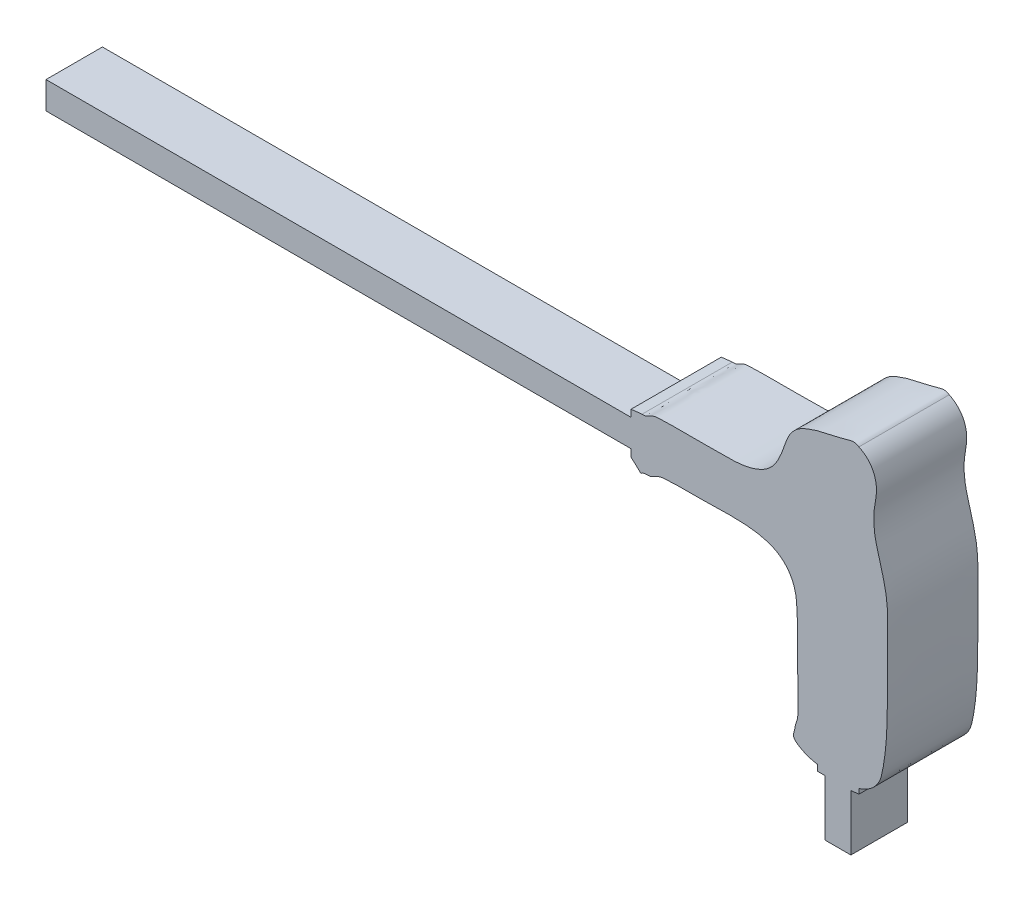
from build123d import *

# Parameters (mm, degrees)
BOSS_EXTRU_1_DEPTH      = 10
BOSS_EXTRU_1_DEPTH_BACK = 10
ESQUISSE2_W             = 5.766727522
ESQUISSE2_H             = 12.37574571
ESQUISSE2_W_2           = 129.608310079
ESQUISSE2_H_2           = 6.025962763
ENL_V_MAT_EXTRU_1_DEPTH = 7.5


with BuildPart() as part:
    # Esquisse1 → Boss.-Extru.1 (new, two sides: drawn at the far end of the back side and taken through both)
    with BuildSketch(Plane.XY.offset(-BOSS_EXTRU_1_DEPTH_BACK)):
        with BuildLine():
            Line((195.497714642, 123.990614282), (65.889404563, 123.990614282))
            Line((65.889404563, 123.990614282), (65.889404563, 117.964651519))
            Line((65.889404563, 117.964651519), (195.497714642, 117.964651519))
            Line((195.497714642, 117.964651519), (195.497714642, 116.351897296))
            Line((195.497714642, 116.351897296), (197.705183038, 114.30907528))
            add(Edge.make_bspline(
                [(236.843581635, 78.042521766), (235.28456265, 78.316299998), (233.521456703, 78.84463056), (231.198458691, 80.614398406), (231.780761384, 82.053226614), (231.859692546, 83.184464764), (232.290333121, 84.182278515), (232.561197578, 85.7866572), (232.398121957, 87.955168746), (232.454462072, 91.543452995), (232.470670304, 95.893022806), (232.295179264, 101.044593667), (232.375496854, 105.606473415), (231.902730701, 109.310050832), (230.552288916, 112.024802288), (228.280720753, 114.37531856), (223.748837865, 116.021772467), (217.495331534, 116.283400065), (210.274281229, 115.968831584), (205.015840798, 116.116279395), (201.411409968, 115.788128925), (199.876415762, 114.437945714), (198.232852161, 114.845899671), (197.705183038, 114.30907528)],
                knots=[0, 0, 0, 0, 0.063283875, 0.08556396, 0.103467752, 0.120478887, 0.133685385, 0.148073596, 0.187908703, 0.223722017, 0.297751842, 0.369138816, 0.438388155, 0.488267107, 0.52262677, 0.563108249, 0.621305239, 0.717918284, 0.822697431, 0.922268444, 0.938122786, 0.97164923, 1, 1, 1, 1], degree=3))
            Line((236.843581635, 78.042521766), (236.843581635, 76.735731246))
            Line((236.843581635, 76.735731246), (238.433512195, 76.735731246))
            Line((238.433512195, 76.735731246), (238.433512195, 64.359985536))
            Line((238.433512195, 64.359985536), (244.200239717, 64.359985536))
            Line((244.200239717, 64.359985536), (244.200239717, 76.735731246))
            Line((244.200239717, 76.735731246), (245.991842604, 76.93587712))
            Line((245.991842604, 76.93587712), (245.991842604, 78.042521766))
            add(Edge.make_bspline(
                [(245.991842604, 143.557265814), (247.266442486, 142.968169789), (248.993977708, 141.361715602), (249.913740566, 138.419589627), (249.870199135, 135.851869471), (249.319190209, 133.663097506), (249.268414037, 131.222384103), (249.354587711, 128.763510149), (250.234332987, 125.223812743), (251.424885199, 121.264419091), (252.369352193, 116.605449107), (252.359827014, 112.122415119), (252.3585223, 107.105758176), (252.37955762, 101.542835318), (252.28864511, 95.240217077), (252.065664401, 89.505760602), (251.418067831, 84.885440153), (250.497255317, 80.497551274), (247.801295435, 78.520307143), (245.991842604, 78.042521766)],
                knots=[0, 0, 0, 0, 0.060051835, 0.09600329, 0.129241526, 0.169235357, 0.192377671, 0.233874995, 0.274511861, 0.348462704, 0.411850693, 0.477690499, 0.540454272, 0.627574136, 0.716580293, 0.811500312, 0.873296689, 0.918097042, 1, 1, 1, 1], degree=3))
            add(Edge.make_bspline(
                [(197.943057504, 125.813250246), (198.992423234, 125.653607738), (199.959921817, 126.762022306), (201.643976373, 126.851415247), (203.289474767, 126.962166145), (205.558901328, 126.945509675), (208.474048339, 126.954576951), (211.541345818, 126.935471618), (214.848083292, 127.007534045), (218.627037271, 126.936784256), (222.661130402, 127.486615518), (226.97504124, 129.687062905), (229.092041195, 133.98962435), (230.148539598, 137.918538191), (232.208881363, 140.197703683), (234.684818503, 141.446956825), (238.253004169, 142.53914311), (242.148541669, 143.16497191), (245.078392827, 144.226488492), (245.991842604, 143.557265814)],
                knots=[0, 0, 0, 0, 0.05227165, 0.067887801, 0.089630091, 0.141730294, 0.190105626, 0.24716371, 0.307325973, 0.368728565, 0.451112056, 0.525809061, 0.618983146, 0.698703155, 0.744116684, 0.779342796, 0.847504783, 0.943259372, 1, 1, 1, 1], degree=3))
            Line((197.943057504, 125.813250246), (195.497714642, 125.540072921))
            Line((195.497714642, 125.540072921), (195.497714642, 123.990614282))
        make_face()
    extrude(amount=BOSS_EXTRU_1_DEPTH + BOSS_EXTRU_1_DEPTH_BACK)

    # Esquisse2 → Enl_v. mat.-Extru.1 (cut)
    with BuildSketch(Plane(origin=(0, 0, -10), x_dir=(-1, 0, 0), z_dir=(0, 0, -1))):
        with Locations((-241.316875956, 70.547858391)):
            Rectangle(ESQUISSE2_W, ESQUISSE2_H)
        with Locations((-130.693559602, 120.977632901)):
            Rectangle(ESQUISSE2_W_2, ESQUISSE2_H_2)
    extrude(amount=-ENL_V_MAT_EXTRU_1_DEPTH, mode=Mode.SUBTRACT)


solid = part.part
